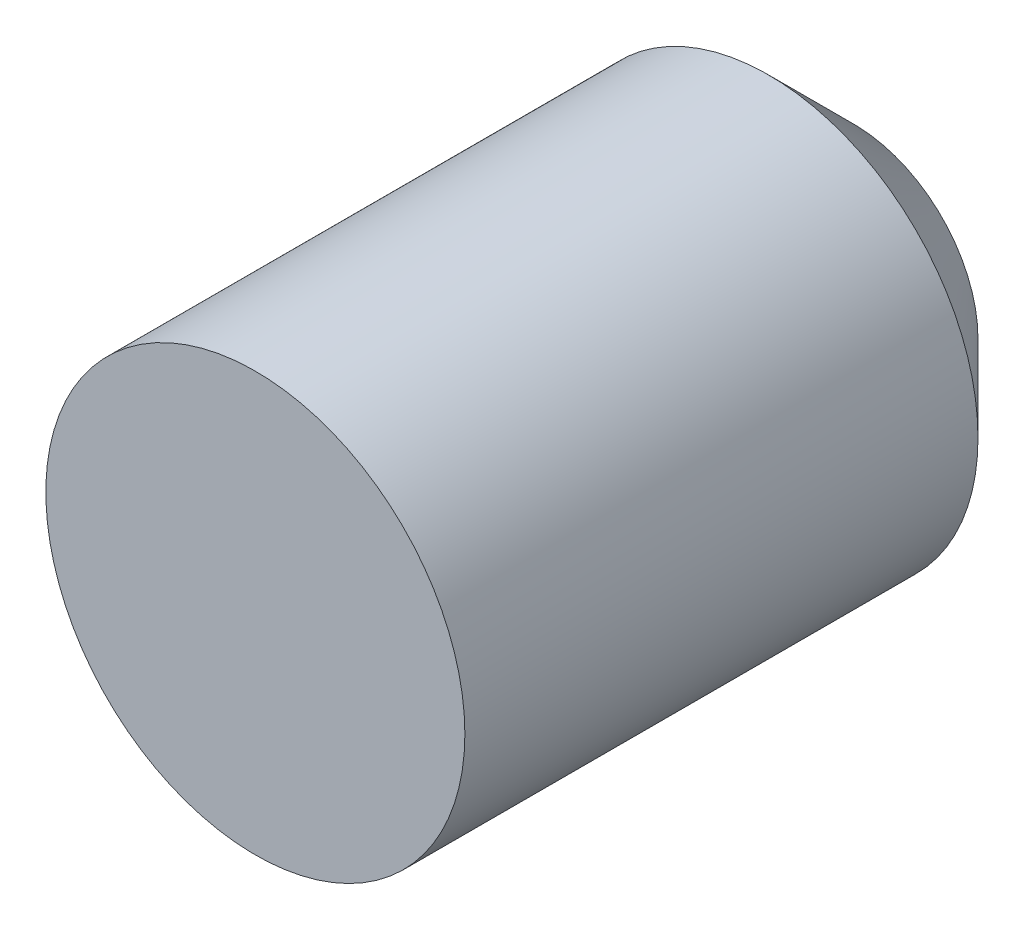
ISO-10303-21;
HEADER;
FILE_DESCRIPTION(('STEP AP214'),'2;1');
FILE_NAME('part.step','',(''),(''),'','','');
FILE_SCHEMA(('AUTOMOTIVE_DESIGN { 1 0 10303 214 1 1 1 1 }'));
ENDSEC;
DATA;
#1=APPLICATION_CONTEXT('core data for automotive mechanical design processes');
#2=APPLICATION_PROTOCOL_DEFINITION('international standard','automotive_design',2000,#1);
#3=PRODUCT_CONTEXT('',#1,'mechanical');
#4=PRODUCT('Part','Part','',(#3));
#5=PRODUCT_RELATED_PRODUCT_CATEGORY('part','',(#4));
#6=PRODUCT_DEFINITION_FORMATION('','',#4);
#7=PRODUCT_DEFINITION_CONTEXT('part definition',#1,'design');
#8=PRODUCT_DEFINITION('design','',#6,#7);
#9=PRODUCT_DEFINITION_SHAPE('','',#8);
#10=(LENGTH_UNIT() NAMED_UNIT(*) SI_UNIT(.MILLI.,.METRE.));
#11=(NAMED_UNIT(*) PLANE_ANGLE_UNIT() SI_UNIT($,.RADIAN.));
#12=(NAMED_UNIT(*) SI_UNIT($,.STERADIAN.) SOLID_ANGLE_UNIT());
#13=UNCERTAINTY_MEASURE_WITH_UNIT(LENGTH_MEASURE(1.E-05),#10,'distance_accuracy_value','');
#14=(GEOMETRIC_REPRESENTATION_CONTEXT(3) GLOBAL_UNCERTAINTY_ASSIGNED_CONTEXT((#13)) GLOBAL_UNIT_ASSIGNED_CONTEXT((#10,
#11,#12)) REPRESENTATION_CONTEXT('',''));
#15=CARTESIAN_POINT('',(0.,0.,0.));
#16=DIRECTION('',(0.,0.,1.));
#17=DIRECTION('',(1.,0.,0.));
#18=AXIS2_PLACEMENT_3D('',#15,#16,#17);
#19=CARTESIAN_POINT('',(0.,0.,0.));
#20=DIRECTION('',(0.,0.,-1.));
#21=DIRECTION('',(-1.,0.,0.));
#22=AXIS2_PLACEMENT_3D('',#19,#20,#21);
#23=PLANE('',#22);
#24=CARTESIAN_POINT('',(0.,0.,-4.54747350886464E-10));
#25=DIRECTION('',(0.,0.,1.));
#26=DIRECTION('',(1.,0.,0.));
#27=AXIS2_PLACEMENT_3D('',#24,#25,#26);
#28=CIRCLE('',#27,1.45000000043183);
#29=CARTESIAN_POINT('',(1.45000000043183,0.,-4.54747350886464E-10));
#30=VERTEX_POINT('',#29);
#31=EDGE_CURVE('E18',#30,#30,#28,.T.);
#32=ORIENTED_EDGE('',*,*,#31,.F.);
#33=EDGE_LOOP('',(#32));
#34=FACE_BOUND('',#33,.T.);
#35=ADVANCED_FACE('F15',(#34),#23,.T.);
#36=CARTESIAN_POINT('',(0.,0.,7.));
#37=DIRECTION('',(0.,0.,-1.));
#38=DIRECTION('',(-1.,0.,0.));
#39=AXIS2_PLACEMENT_3D('',#36,#37,#38);
#40=PLANE('',#39);
#41=CARTESIAN_POINT('',(0.,0.,7.));
#42=DIRECTION('',(0.,0.,1.));
#43=DIRECTION('',(1.,0.,0.));
#44=AXIS2_PLACEMENT_3D('',#41,#42,#43);
#45=CIRCLE('',#44,2.45);
#46=CARTESIAN_POINT('',(2.45,0.,7.));
#47=VERTEX_POINT('',#46);
#48=EDGE_CURVE('E23',#47,#47,#45,.F.);
#49=ORIENTED_EDGE('',*,*,#48,.F.);
#50=EDGE_LOOP('',(#49));
#51=FACE_BOUND('',#50,.T.);
#52=ADVANCED_FACE('F46',(#51),#40,.F.);
#53=CARTESIAN_POINT('',(0.,0.,1.00000000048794));
#54=DIRECTION('',(0.,0.,1.));
#55=DIRECTION('',(1.,0.,0.));
#56=AXIS2_PLACEMENT_3D('',#53,#54,#55);
#57=CONICAL_SURFACE('',#56,2.44999999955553,0.785398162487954);
#58=ORIENTED_EDGE('',*,*,#31,.T.);
#59=EDGE_LOOP('',(#58));
#60=FACE_BOUND('',#59,.T.);
#61=CARTESIAN_POINT('',(0.,0.,1.));
#62=DIRECTION('',(0.,0.,1.));
#63=DIRECTION('',(1.,0.,0.));
#64=AXIS2_PLACEMENT_3D('',#61,#62,#63);
#65=CIRCLE('',#64,2.45);
#66=CARTESIAN_POINT('',(2.44999999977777,0.,1.00000000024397));
#67=VERTEX_POINT('',#66);
#68=EDGE_CURVE('E10',#67,#67,#65,.T.);
#69=ORIENTED_EDGE('',*,*,#68,.F.);
#70=EDGE_LOOP('',(#69));
#71=FACE_BOUND('',#70,.T.);
#72=ADVANCED_FACE('F36',(#60,#71),#57,.T.);
#73=CARTESIAN_POINT('',(0.,0.,0.));
#74=DIRECTION('',(0.,0.,1.));
#75=DIRECTION('',(1.,0.,0.));
#76=AXIS2_PLACEMENT_3D('',#73,#74,#75);
#77=CYLINDRICAL_SURFACE('',#76,2.45);
#78=ORIENTED_EDGE('',*,*,#68,.T.);
#79=EDGE_LOOP('',(#78));
#80=FACE_BOUND('',#79,.T.);
#81=ORIENTED_EDGE('',*,*,#48,.T.);
#82=EDGE_LOOP('',(#81));
#83=FACE_BOUND('',#82,.T.);
#84=ADVANCED_FACE('F38',(#80,#83),#77,.T.);
#85=CLOSED_SHELL('',(#35,#52,#72,#84));
#86=MANIFOLD_SOLID_BREP('B1',#85);
#87=ADVANCED_BREP_SHAPE_REPRESENTATION('',(#18,#86),#14);
#88=SHAPE_DEFINITION_REPRESENTATION(#9,#87);
ENDSEC;
END-ISO-10303-21;
